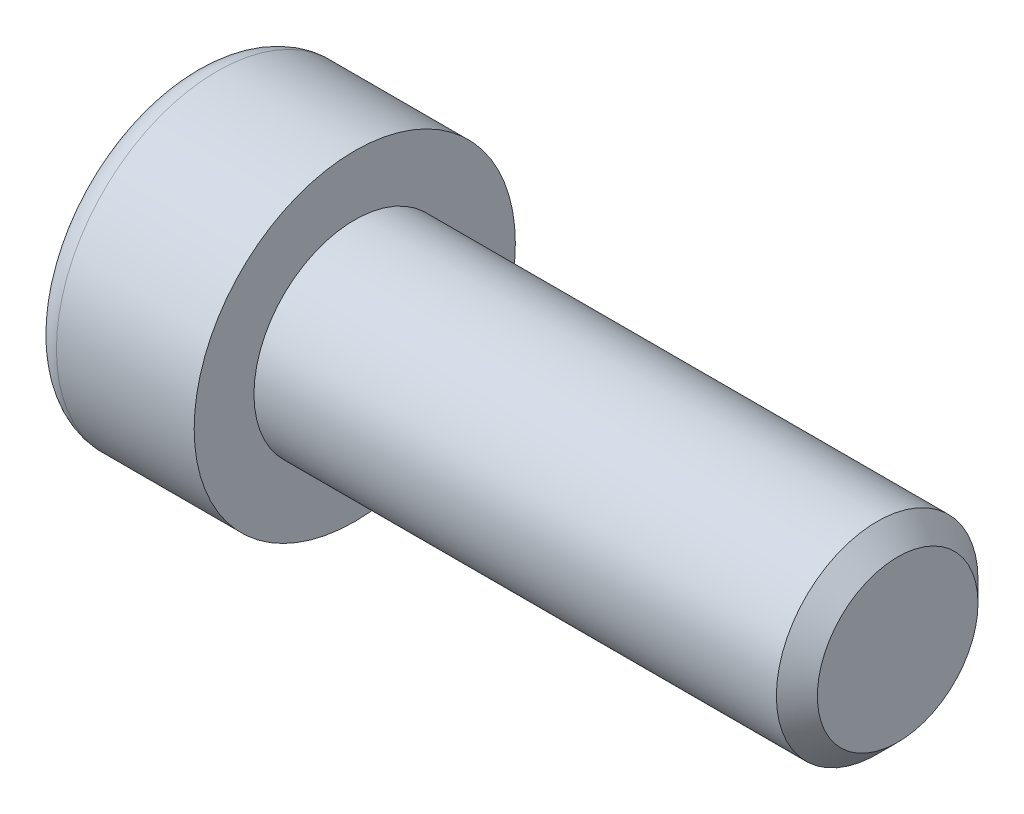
from build123d import *

# Parameters (mm, degrees)
ENL_V_MAT_EXTRU_1_DEPTH = 3
CONG_1_R                = 0.5


with BuildPart() as part:
    # Esquisse1 → R_volution1 (revolve)
    with BuildSketch(Plane.XY, mode=Mode.PRIVATE) as r_volution1_sk:
        with BuildLine():
            Line((-384.724114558, 346.45173931), (-405.451180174, 346.45173931))
            Line((-405.451180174, 346.45173931), (-405.451180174, 348.823102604))
            Line((-405.451180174, 348.823102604), (-410.916586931, 348.823102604))
            ThreePointArc((-410.916586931, 348.823102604), (-411.623693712, 348.530209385), (-411.916586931, 347.823102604))
            Line((-411.916586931, 347.823102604), (-411.916586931, 342.45173931))
            Line((-411.916586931, 342.45173931), (-383.911125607, 342.45173931))
            Line((-383.911125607, 342.45173931), (-383.911125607, 345.638750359))
            Line((-383.911125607, 345.638750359), (-384.724114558, 346.45173931))
        make_face()
    revolve(r_volution1_sk.sketch.rotate(Axis((-383.911125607, 342.45173931, 0), (-1, 0, 0)), 90), axis=Axis((-383.911125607, 342.45173931, 0), (-1, 0, 0)))

    # Esquisse2 → Enl_v. mat.-Extru.1 (cut)
    with BuildSketch(Plane.ZY.offset(411.916586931)):
        Polygon((-3.269339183, 343.387000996), (-2.44462997, 340.088039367), (0.824709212, 339.152777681), (3.269339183, 341.516477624), (2.44462997, 344.815439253), (-0.824709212, 345.750700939), align=None)
    extrude(amount=-ENL_V_MAT_EXTRU_1_DEPTH, mode=Mode.SUBTRACT)

    # Cong_1
    cong_1_edges = [part.edges().sort_by_distance(p)[0] for p in [
        (-408.916586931, 344.568850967, -2.047024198),
        (-408.916586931, 345.283070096, 0.809960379),
        (-408.916586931, 343.165958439, 2.856984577),
        (-408.916586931, 340.334627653, 2.047024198),
        (-408.916586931, 339.620408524, -0.809960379),
        (-408.916586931, 341.737520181, -2.856984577),
    ]]
    fillet(cong_1_edges, radius=CONG_1_R)


solid = part.part
